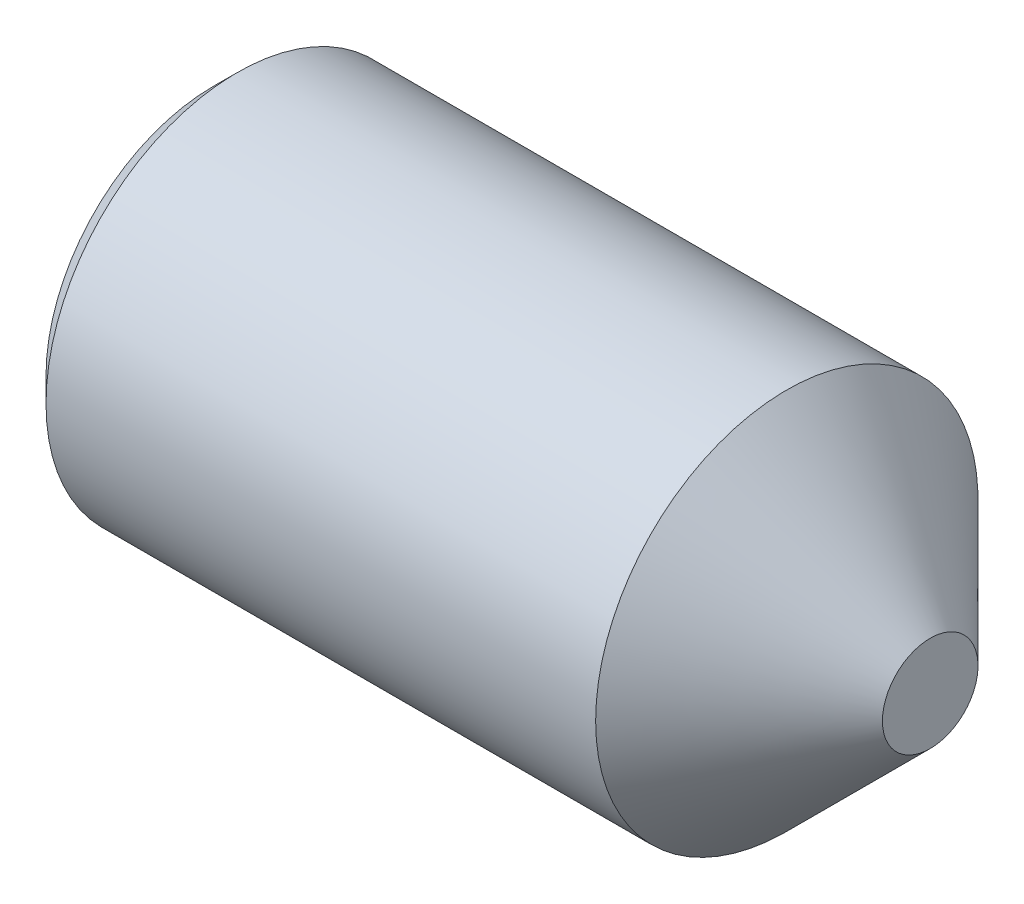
ISO-10303-21;
HEADER;
FILE_DESCRIPTION(('STEP AP214'),'2;1');
FILE_NAME('part.step','',(''),(''),'','','');
FILE_SCHEMA(('AUTOMOTIVE_DESIGN { 1 0 10303 214 1 1 1 1 }'));
ENDSEC;
DATA;
#1=APPLICATION_CONTEXT('core data for automotive mechanical design processes');
#2=APPLICATION_PROTOCOL_DEFINITION('international standard','automotive_design',2000,#1);
#3=PRODUCT_CONTEXT('',#1,'mechanical');
#4=PRODUCT('Part','Part','',(#3));
#5=PRODUCT_RELATED_PRODUCT_CATEGORY('part','',(#4));
#6=PRODUCT_DEFINITION_FORMATION('','',#4);
#7=PRODUCT_DEFINITION_CONTEXT('part definition',#1,'design');
#8=PRODUCT_DEFINITION('design','',#6,#7);
#9=PRODUCT_DEFINITION_SHAPE('','',#8);
#10=(LENGTH_UNIT() NAMED_UNIT(*) SI_UNIT(.MILLI.,.METRE.));
#11=(NAMED_UNIT(*) PLANE_ANGLE_UNIT() SI_UNIT($,.RADIAN.));
#12=(NAMED_UNIT(*) SI_UNIT($,.STERADIAN.) SOLID_ANGLE_UNIT());
#13=UNCERTAINTY_MEASURE_WITH_UNIT(LENGTH_MEASURE(1.E-05),#10,'distance_accuracy_value','');
#14=(GEOMETRIC_REPRESENTATION_CONTEXT(3) GLOBAL_UNCERTAINTY_ASSIGNED_CONTEXT((#13)) GLOBAL_UNIT_ASSIGNED_CONTEXT((#10,
#11,#12)) REPRESENTATION_CONTEXT('',''));
#15=CARTESIAN_POINT('',(0.,0.,0.));
#16=DIRECTION('',(0.,0.,1.));
#17=DIRECTION('',(1.,0.,0.));
#18=AXIS2_PLACEMENT_3D('',#15,#16,#17);
#19=CARTESIAN_POINT('',(0.699999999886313,0.,0.404145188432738));
#20=DIRECTION('',(-1.,0.,0.));
#21=DIRECTION('',(0.,0.,1.));
#22=AXIS2_PLACEMENT_3D('',#19,#20,#21);
#23=PLANE('',#22);
#24=DIRECTION('',(0.,0.,-1.));
#25=VECTOR('',#24,1.);
#26=CARTESIAN_POINT('',(0.699999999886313,0.35,0.202072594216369));
#27=LINE('',#26,#25);
#28=CARTESIAN_POINT('',(0.699999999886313,0.35,0.202072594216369));
#29=VERTEX_POINT('',#28);
#30=CARTESIAN_POINT('',(0.699999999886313,0.35,0.));
#31=VERTEX_POINT('',#30);
#32=EDGE_CURVE('E167',#29,#31,#27,.T.);
#33=ORIENTED_EDGE('',*,*,#32,.T.);
#34=CARTESIAN_POINT('',(0.699999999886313,0.,0.));
#35=DIRECTION('',(1.,0.,0.));
#36=DIRECTION('',(0.,1.,0.));
#37=AXIS2_PLACEMENT_3D('',#34,#35,#36);
#38=CIRCLE('',#37,0.35);
#39=CARTESIAN_POINT('',(0.699999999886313,0.175,0.303108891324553));
#40=VERTEX_POINT('',#39);
#41=EDGE_CURVE('E54',#31,#40,#38,.T.);
#42=ORIENTED_EDGE('',*,*,#41,.T.);
#43=DIRECTION('',(0.,0.866025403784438,-0.500000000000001));
#44=VECTOR('',#43,1.);
#45=CARTESIAN_POINT('',(0.699999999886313,0.,0.404145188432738));
#46=LINE('',#45,#44);
#47=EDGE_CURVE('E223',#40,#29,#46,.T.);
#48=ORIENTED_EDGE('',*,*,#47,.T.);
#49=EDGE_LOOP('',(#33,#42,#48));
#50=FACE_BOUND('',#49,.T.);
#51=ADVANCED_FACE('F43',(#50),#23,.T.);
#52=CARTESIAN_POINT('',(0.699999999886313,0.,0.404145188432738));
#53=VERTEX_POINT('',#52);
#54=EDGE_CURVE('E228',#53,#40,#46,.T.);
#55=ORIENTED_EDGE('',*,*,#54,.T.);
#56=CARTESIAN_POINT('',(0.699999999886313,-0.175,0.303108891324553));
#57=VERTEX_POINT('',#56);
#58=EDGE_CURVE('E11',#40,#57,#38,.T.);
#59=ORIENTED_EDGE('',*,*,#58,.T.);
#60=DIRECTION('',(0.,0.866025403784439,0.5));
#61=VECTOR('',#60,1.);
#62=CARTESIAN_POINT('',(0.699999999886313,-0.349999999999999,0.202072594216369));
#63=LINE('',#62,#61);
#64=EDGE_CURVE('E193',#57,#53,#63,.T.);
#65=ORIENTED_EDGE('',*,*,#64,.T.);
#66=EDGE_LOOP('',(#55,#59,#65));
#67=FACE_BOUND('',#66,.T.);
#68=ADVANCED_FACE('F130',(#67),#23,.T.);
#69=CARTESIAN_POINT('',(0.699999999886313,-0.349999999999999,0.202072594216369));
#70=VERTEX_POINT('',#69);
#71=EDGE_CURVE('E229',#70,#57,#63,.T.);
#72=ORIENTED_EDGE('',*,*,#71,.T.);
#73=CARTESIAN_POINT('',(0.699999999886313,-0.35,0.));
#74=VERTEX_POINT('',#73);
#75=EDGE_CURVE('E52',#57,#74,#38,.T.);
#76=ORIENTED_EDGE('',*,*,#75,.T.);
#77=DIRECTION('',(0.,0.,1.));
#78=VECTOR('',#77,1.);
#79=CARTESIAN_POINT('',(0.699999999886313,-0.35,-0.202072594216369));
#80=LINE('',#79,#78);
#81=EDGE_CURVE('E172',#74,#70,#80,.T.);
#82=ORIENTED_EDGE('',*,*,#81,.T.);
#83=EDGE_LOOP('',(#72,#76,#82));
#84=FACE_BOUND('',#83,.T.);
#85=ADVANCED_FACE('F137',(#84),#23,.T.);
#86=CARTESIAN_POINT('',(0.699999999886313,-0.35,-0.202072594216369));
#87=VERTEX_POINT('',#86);
#88=EDGE_CURVE('E173',#87,#74,#80,.T.);
#89=ORIENTED_EDGE('',*,*,#88,.T.);
#90=CARTESIAN_POINT('',(0.699999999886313,-0.175,-0.303108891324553));
#91=VERTEX_POINT('',#90);
#92=EDGE_CURVE('E220',#74,#91,#38,.T.);
#93=ORIENTED_EDGE('',*,*,#92,.T.);
#94=DIRECTION('',(0.,-0.866025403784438,0.5));
#95=VECTOR('',#94,1.);
#96=CARTESIAN_POINT('',(0.699999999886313,0.,-0.404145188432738));
#97=LINE('',#96,#95);
#98=EDGE_CURVE('E162',#91,#87,#97,.T.);
#99=ORIENTED_EDGE('',*,*,#98,.T.);
#100=EDGE_LOOP('',(#89,#93,#99));
#101=FACE_BOUND('',#100,.T.);
#102=ADVANCED_FACE('F151',(#101),#23,.T.);
#103=CARTESIAN_POINT('',(0.699999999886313,0.,-0.404145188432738));
#104=VERTEX_POINT('',#103);
#105=EDGE_CURVE('E165',#104,#91,#97,.T.);
#106=ORIENTED_EDGE('',*,*,#105,.T.);
#107=CARTESIAN_POINT('',(0.699999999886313,0.175,-0.303108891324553));
#108=VERTEX_POINT('',#107);
#109=EDGE_CURVE('E218',#91,#108,#38,.T.);
#110=ORIENTED_EDGE('',*,*,#109,.T.);
#111=DIRECTION('',(0.,-0.866025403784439,-0.5));
#112=VECTOR('',#111,1.);
#113=CARTESIAN_POINT('',(0.699999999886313,0.35,-0.202072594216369));
#114=LINE('',#113,#112);
#115=EDGE_CURVE('E163',#108,#104,#114,.T.);
#116=ORIENTED_EDGE('',*,*,#115,.T.);
#117=EDGE_LOOP('',(#106,#110,#116));
#118=FACE_BOUND('',#117,.T.);
#119=ADVANCED_FACE('F142',(#118),#23,.T.);
#120=CARTESIAN_POINT('',(0.699999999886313,0.35,-0.202072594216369));
#121=VERTEX_POINT('',#120);
#122=EDGE_CURVE('E155',#121,#108,#114,.T.);
#123=ORIENTED_EDGE('',*,*,#122,.T.);
#124=EDGE_CURVE('E156',#108,#31,#38,.T.);
#125=ORIENTED_EDGE('',*,*,#124,.T.);
#126=EDGE_CURVE('E158',#31,#121,#27,.T.);
#127=ORIENTED_EDGE('',*,*,#126,.T.);
#128=EDGE_LOOP('',(#123,#125,#127));
#129=FACE_BOUND('',#128,.T.);
#130=ADVANCED_FACE('F132',(#129),#23,.T.);
#131=CARTESIAN_POINT('',(0.,0.7,0.));
#132=DIRECTION('',(1.,0.,0.));
#133=DIRECTION('',(0.,0.,-1.));
#134=AXIS2_PLACEMENT_3D('',#131,#132,#133);
#135=PLANE('',#134);
#136=DIRECTION('',(0.,0.866025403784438,-0.500000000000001));
#137=VECTOR('',#136,1.);
#138=CARTESIAN_POINT('',(-1.13686837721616E-10,0.,0.404145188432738));
#139=LINE('',#138,#137);
#140=CARTESIAN_POINT('',(0.,0.,0.404145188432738));
#141=VERTEX_POINT('',#140);
#142=CARTESIAN_POINT('',(-1.13686837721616E-10,0.35,0.202072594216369));
#143=VERTEX_POINT('',#142);
#144=EDGE_CURVE('E178',#141,#143,#139,.T.);
#145=ORIENTED_EDGE('',*,*,#144,.F.);
#146=DIRECTION('',(0.,0.866025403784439,0.5));
#147=VECTOR('',#146,1.);
#148=CARTESIAN_POINT('',(-1.13686837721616E-10,-0.349999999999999,0.202072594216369));
#149=LINE('',#148,#147);
#150=CARTESIAN_POINT('',(-1.13686837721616E-10,-0.349999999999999,0.202072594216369));
#151=VERTEX_POINT('',#150);
#152=EDGE_CURVE('E68',#151,#141,#149,.T.);
#153=ORIENTED_EDGE('',*,*,#152,.F.);
#154=DIRECTION('',(0.,0.,1.));
#155=VECTOR('',#154,1.);
#156=CARTESIAN_POINT('',(-1.13686837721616E-10,-0.35,-0.202072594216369));
#157=LINE('',#156,#155);
#158=CARTESIAN_POINT('',(-1.13686837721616E-10,-0.35,-0.202072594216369));
#159=VERTEX_POINT('',#158);
#160=EDGE_CURVE('E190',#159,#151,#157,.T.);
#161=ORIENTED_EDGE('',*,*,#160,.F.);
#162=DIRECTION('',(0.,-0.866025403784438,0.5));
#163=VECTOR('',#162,1.);
#164=CARTESIAN_POINT('',(-1.13686837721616E-10,0.,-0.404145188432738));
#165=LINE('',#164,#163);
#166=CARTESIAN_POINT('',(-1.13686837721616E-10,0.,-0.404145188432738));
#167=VERTEX_POINT('',#166);
#168=EDGE_CURVE('E187',#167,#159,#165,.T.);
#169=ORIENTED_EDGE('',*,*,#168,.F.);
#170=DIRECTION('',(0.,-0.866025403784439,-0.5));
#171=VECTOR('',#170,1.);
#172=CARTESIAN_POINT('',(-1.13686837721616E-10,0.35,-0.202072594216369));
#173=LINE('',#172,#171);
#174=CARTESIAN_POINT('',(-1.13686837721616E-10,0.35,-0.202072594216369));
#175=VERTEX_POINT('',#174);
#176=EDGE_CURVE('E184',#175,#167,#173,.T.);
#177=ORIENTED_EDGE('',*,*,#176,.F.);
#178=DIRECTION('',(0.,0.,-1.));
#179=VECTOR('',#178,1.);
#180=CARTESIAN_POINT('',(-1.13686837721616E-10,0.35,0.202072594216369));
#181=LINE('',#180,#179);
#182=EDGE_CURVE('E181',#143,#175,#181,.T.);
#183=ORIENTED_EDGE('',*,*,#182,.F.);
#184=EDGE_LOOP('',(#145,#153,#161,#169,#177,#183));
#185=FACE_BOUND('',#184,.T.);
#186=CARTESIAN_POINT('',(0.,0.,0.));
#187=DIRECTION('',(-1.,0.,0.));
#188=DIRECTION('',(0.,0.,1.));
#189=AXIS2_PLACEMENT_3D('',#186,#187,#188);
#190=CIRCLE('',#189,0.7);
#191=CARTESIAN_POINT('',(0.,0.,0.7));
#192=VERTEX_POINT('',#191);
#193=EDGE_CURVE('E196',#192,#192,#190,.T.);
#194=ORIENTED_EDGE('',*,*,#193,.T.);
#195=EDGE_LOOP('',(#194));
#196=FACE_BOUND('',#195,.T.);
#197=ADVANCED_FACE('F45',(#185,#196),#135,.F.);
#198=CARTESIAN_POINT('',(3.,0.,0.));
#199=DIRECTION('',(-1.,0.,0.));
#200=DIRECTION('',(0.,0.,1.));
#201=AXIS2_PLACEMENT_3D('',#198,#199,#200);
#202=PLANE('',#201);
#203=CARTESIAN_POINT('',(3.,0.,0.));
#204=DIRECTION('',(-1.,0.,0.));
#205=DIRECTION('',(0.,0.,1.));
#206=AXIS2_PLACEMENT_3D('',#203,#204,#205);
#207=CIRCLE('',#206,0.2);
#208=CARTESIAN_POINT('',(3.,0.,0.2));
#209=VERTEX_POINT('',#208);
#210=EDGE_CURVE('E47',#209,#209,#207,.T.);
#211=ORIENTED_EDGE('',*,*,#210,.F.);
#212=EDGE_LOOP('',(#211));
#213=FACE_BOUND('',#212,.T.);
#214=ADVANCED_FACE('F149',(#213),#202,.F.);
#215=CARTESIAN_POINT('',(3.,0.,0.));
#216=DIRECTION('',(-1.,0.,0.));
#217=DIRECTION('',(0.,0.,1.));
#218=AXIS2_PLACEMENT_3D('',#215,#216,#217);
#219=CONICAL_SURFACE('',#218,0.2,0.785398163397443);
#220=CARTESIAN_POINT('',(2.39999999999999,0.,0.));
#221=DIRECTION('',(-1.,0.,0.));
#222=DIRECTION('',(0.,0.,1.));
#223=AXIS2_PLACEMENT_3D('',#220,#221,#222);
#224=CIRCLE('',#223,0.8);
#225=CARTESIAN_POINT('',(2.39999999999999,0.,0.8));
#226=VERTEX_POINT('',#225);
#227=EDGE_CURVE('E211',#226,#226,#224,.T.);
#228=CARTESIAN_POINT('',(2.39999999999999,0.,0.8));
#229=CARTESIAN_POINT('',(2.40624999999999,0.,0.79375));
#230=CARTESIAN_POINT('',(2.41249999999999,0.,0.7875));
#231=CARTESIAN_POINT('',(2.42499999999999,0.,0.775));
#232=CARTESIAN_POINT('',(2.43124999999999,0.,0.76875));
#233=CARTESIAN_POINT('',(2.44374999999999,0.,0.75625));
#234=CARTESIAN_POINT('',(2.44999999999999,0.,0.75));
#235=CARTESIAN_POINT('',(2.4625,0.,0.7375));
#236=CARTESIAN_POINT('',(2.46875,0.,0.73125));
#237=CARTESIAN_POINT('',(2.48125,0.,0.71875));
#238=CARTESIAN_POINT('',(2.4875,0.,0.7125));
#239=CARTESIAN_POINT('',(2.5,0.,0.7));
#240=CARTESIAN_POINT('',(2.50625,0.,0.69375));
#241=CARTESIAN_POINT('',(2.51875,0.,0.68125));
#242=CARTESIAN_POINT('',(2.525,0.,0.675));
#243=CARTESIAN_POINT('',(2.5375,0.,0.6625));
#244=CARTESIAN_POINT('',(2.54375,0.,0.65625));
#245=CARTESIAN_POINT('',(2.55625,0.,0.64375));
#246=CARTESIAN_POINT('',(2.5625,0.,0.6375));
#247=CARTESIAN_POINT('',(2.575,0.,0.625));
#248=CARTESIAN_POINT('',(2.58125,0.,0.61875));
#249=CARTESIAN_POINT('',(2.59375,0.,0.60625));
#250=CARTESIAN_POINT('',(2.6,0.,0.6));
#251=CARTESIAN_POINT('',(2.6125,0.,0.5875));
#252=CARTESIAN_POINT('',(2.61875,0.,0.58125));
#253=CARTESIAN_POINT('',(2.63125,0.,0.56875));
#254=CARTESIAN_POINT('',(2.6375,0.,0.5625));
#255=CARTESIAN_POINT('',(2.65,0.,0.55));
#256=CARTESIAN_POINT('',(2.65625,0.,0.54375));
#257=CARTESIAN_POINT('',(2.66875,0.,0.53125));
#258=CARTESIAN_POINT('',(2.675,0.,0.525));
#259=CARTESIAN_POINT('',(2.6875,0.,0.5125));
#260=CARTESIAN_POINT('',(2.69375,0.,0.50625));
#261=CARTESIAN_POINT('',(2.70625,0.,0.49375));
#262=CARTESIAN_POINT('',(2.7125,0.,0.4875));
#263=CARTESIAN_POINT('',(2.725,0.,0.475));
#264=CARTESIAN_POINT('',(2.73125,0.,0.46875));
#265=CARTESIAN_POINT('',(2.74375,0.,0.45625));
#266=CARTESIAN_POINT('',(2.75,0.,0.45));
#267=CARTESIAN_POINT('',(2.7625,0.,0.4375));
#268=CARTESIAN_POINT('',(2.76875,0.,0.43125));
#269=CARTESIAN_POINT('',(2.78125,0.,0.41875));
#270=CARTESIAN_POINT('',(2.7875,0.,0.4125));
#271=CARTESIAN_POINT('',(2.8,0.,0.4));
#272=CARTESIAN_POINT('',(2.80625,0.,0.39375));
#273=CARTESIAN_POINT('',(2.81875,0.,0.38125));
#274=CARTESIAN_POINT('',(2.825,0.,0.375));
#275=CARTESIAN_POINT('',(2.8375,0.,0.3625));
#276=CARTESIAN_POINT('',(2.84375,0.,0.35625));
#277=CARTESIAN_POINT('',(2.85625,0.,0.34375));
#278=CARTESIAN_POINT('',(2.8625,0.,0.3375));
#279=CARTESIAN_POINT('',(2.875,0.,0.325));
#280=CARTESIAN_POINT('',(2.88125,0.,0.31875));
#281=CARTESIAN_POINT('',(2.89375,0.,0.30625));
#282=CARTESIAN_POINT('',(2.9,0.,0.3));
#283=CARTESIAN_POINT('',(2.9125,0.,0.2875));
#284=CARTESIAN_POINT('',(2.91875,0.,0.28125));
#285=CARTESIAN_POINT('',(2.93125,0.,0.26875));
#286=CARTESIAN_POINT('',(2.9375,0.,0.2625));
#287=CARTESIAN_POINT('',(2.95,0.,0.25));
#288=CARTESIAN_POINT('',(2.95625,0.,0.24375));
#289=CARTESIAN_POINT('',(2.96875,0.,0.23125));
#290=CARTESIAN_POINT('',(2.975,0.,0.225));
#291=CARTESIAN_POINT('',(2.9875,0.,0.2125));
#292=CARTESIAN_POINT('',(2.99375,0.,0.20625));
#293=CARTESIAN_POINT('',(3.,0.,0.2));
#294=B_SPLINE_CURVE_WITH_KNOTS('',3,(#228,#229,#230,#231,#232,#233,#234,#235,#236,#237,#238,
#239,#240,#241,#242,#243,#244,#245,#246,#247,#248,#249,#250,#251,#252,#253,#254,#255,#256,#257,
#258,#259,#260,#261,#262,#263,#264,#265,#266,#267,#268,#269,#270,#271,#272,#273,#274,#275,#276,
#277,#278,#279,#280,#281,#282,#283,#284,#285,#286,#287,#288,#289,#290,#291,#292,#293),
.UNSPECIFIED.,.F.,.F.,(4,2,2,2,2,2,2,2,2,2,2,2,2,2,2,2,2,2,2,2,2,2,2,2,2,2,2,2,2,2,2,2,4),(0.,
0.026516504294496,0.0530330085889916,0.0795495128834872,0.106066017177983,0.132582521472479,
0.159099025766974,0.18561553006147,0.212132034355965,0.238648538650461,0.265165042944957,
0.291681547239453,0.318198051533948,0.344714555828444,0.37123106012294,0.397747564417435,
0.424264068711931,0.450780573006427,0.477297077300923,0.503813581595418,0.530330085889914,
0.55684659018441,0.583363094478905,0.609879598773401,0.636396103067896,0.662912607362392,
0.689429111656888,0.715945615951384,0.742462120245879,0.768978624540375,0.795495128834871,
0.822011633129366,0.848528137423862),.UNSPECIFIED.);
#295=EDGE_CURVE('BSEAM275',#226,#209,#294,.T.);
#296=ORIENTED_EDGE('',*,*,#227,.F.);
#297=ORIENTED_EDGE('',*,*,#210,.T.);
#298=ORIENTED_EDGE('',*,*,#295,.T.);
#299=ORIENTED_EDGE('',*,*,#295,.F.);
#300=EDGE_LOOP('',(#296,#298,#297,#299));
#301=FACE_BOUND('',#300,.T.);
#302=ADVANCED_FACE('F275',(#301),#219,.T.);
#303=CARTESIAN_POINT('',(-14.774129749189,0.,0.));
#304=DIRECTION('',(-1.,0.,0.));
#305=DIRECTION('',(0.,0.,1.));
#306=AXIS2_PLACEMENT_3D('',#303,#304,#305);
#307=CYLINDRICAL_SURFACE('',#306,0.8);
#308=CARTESIAN_POINT('',(0.100000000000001,0.,0.));
#309=DIRECTION('',(-1.,0.,0.));
#310=DIRECTION('',(0.,0.,1.));
#311=AXIS2_PLACEMENT_3D('',#308,#309,#310);
#312=CIRCLE('',#311,0.8);
#313=CARTESIAN_POINT('',(0.100000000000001,0.,0.8));
#314=VERTEX_POINT('',#313);
#315=EDGE_CURVE('E209',#314,#314,#312,.T.);
#316=ORIENTED_EDGE('',*,*,#315,.F.);
#317=EDGE_LOOP('',(#316));
#318=FACE_BOUND('',#317,.T.);
#319=ORIENTED_EDGE('',*,*,#227,.T.);
#320=EDGE_LOOP('',(#319));
#321=FACE_BOUND('',#320,.T.);
#322=ADVANCED_FACE('F271',(#318,#321),#307,.T.);
#323=CARTESIAN_POINT('',(0.100000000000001,0.,0.));
#324=DIRECTION('',(1.,0.,0.));
#325=DIRECTION('',(0.,0.,-1.));
#326=AXIS2_PLACEMENT_3D('',#323,#324,#325);
#327=CONICAL_SURFACE('',#326,0.8,0.785398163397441);
#328=ORIENTED_EDGE('',*,*,#193,.F.);
#329=EDGE_LOOP('',(#328));
#330=FACE_BOUND('',#329,.T.);
#331=ORIENTED_EDGE('',*,*,#315,.T.);
#332=EDGE_LOOP('',(#331));
#333=FACE_BOUND('',#332,.T.);
#334=ADVANCED_FACE('F262',(#330,#333),#327,.T.);
#335=CARTESIAN_POINT('',(0.699999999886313,-0.349999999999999,0.202072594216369));
#336=DIRECTION('',(0.,-0.5,0.866025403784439));
#337=DIRECTION('',(0.,-0.866025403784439,-0.5));
#338=AXIS2_PLACEMENT_3D('',#335,#336,#337);
#339=PLANE('',#338);
#340=ORIENTED_EDGE('',*,*,#152,.T.);
#341=DIRECTION('',(-1.,0.,0.));
#342=VECTOR('',#341,1.);
#343=CARTESIAN_POINT('',(0.699999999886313,0.,0.404145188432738));
#344=LINE('',#343,#342);
#345=EDGE_CURVE('E176',#53,#141,#344,.T.);
#346=ORIENTED_EDGE('',*,*,#345,.F.);
#347=ORIENTED_EDGE('',*,*,#64,.F.);
#348=ORIENTED_EDGE('',*,*,#71,.F.);
#349=DIRECTION('',(-1.,0.,0.));
#350=VECTOR('',#349,1.);
#351=CARTESIAN_POINT('',(0.699999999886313,-0.349999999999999,0.202072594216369));
#352=LINE('',#351,#350);
#353=EDGE_CURVE('E194',#70,#151,#352,.T.);
#354=ORIENTED_EDGE('',*,*,#353,.T.);
#355=EDGE_LOOP('',(#340,#346,#347,#348,#354));
#356=FACE_BOUND('',#355,.T.);
#357=ADVANCED_FACE('F237',(#356),#339,.F.);
#358=CARTESIAN_POINT('',(0.699999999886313,-0.35,-0.202072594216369));
#359=DIRECTION('',(0.,-1.,0.));
#360=DIRECTION('',(0.,0.,-1.));
#361=AXIS2_PLACEMENT_3D('',#358,#359,#360);
#362=PLANE('',#361);
#363=ORIENTED_EDGE('',*,*,#160,.T.);
#364=ORIENTED_EDGE('',*,*,#353,.F.);
#365=ORIENTED_EDGE('',*,*,#81,.F.);
#366=ORIENTED_EDGE('',*,*,#88,.F.);
#367=DIRECTION('',(-1.,0.,0.));
#368=VECTOR('',#367,1.);
#369=CARTESIAN_POINT('',(0.699999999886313,-0.35,-0.202072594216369));
#370=LINE('',#369,#368);
#371=EDGE_CURVE('E197',#87,#159,#370,.T.);
#372=ORIENTED_EDGE('',*,*,#371,.T.);
#373=EDGE_LOOP('',(#363,#364,#365,#366,#372));
#374=FACE_BOUND('',#373,.T.);
#375=ADVANCED_FACE('F256',(#374),#362,.F.);
#376=CARTESIAN_POINT('',(0.699999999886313,0.,-0.404145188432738));
#377=DIRECTION('',(0.,-0.5,-0.866025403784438));
#378=DIRECTION('',(0.,0.866025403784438,-0.5));
#379=AXIS2_PLACEMENT_3D('',#376,#377,#378);
#380=PLANE('',#379);
#381=ORIENTED_EDGE('',*,*,#168,.T.);
#382=ORIENTED_EDGE('',*,*,#371,.F.);
#383=ORIENTED_EDGE('',*,*,#98,.F.);
#384=ORIENTED_EDGE('',*,*,#105,.F.);
#385=DIRECTION('',(-1.,0.,0.));
#386=VECTOR('',#385,1.);
#387=CARTESIAN_POINT('',(0.699999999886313,0.,-0.404145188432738));
#388=LINE('',#387,#386);
#389=EDGE_CURVE('E199',#104,#167,#388,.T.);
#390=ORIENTED_EDGE('',*,*,#389,.T.);
#391=EDGE_LOOP('',(#381,#382,#383,#384,#390));
#392=FACE_BOUND('',#391,.T.);
#393=ADVANCED_FACE('F250',(#392),#380,.F.);
#394=CARTESIAN_POINT('',(0.699999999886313,0.35,-0.202072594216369));
#395=DIRECTION('',(0.,0.5,-0.866025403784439));
#396=DIRECTION('',(0.,0.866025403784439,0.5));
#397=AXIS2_PLACEMENT_3D('',#394,#395,#396);
#398=PLANE('',#397);
#399=ORIENTED_EDGE('',*,*,#176,.T.);
#400=ORIENTED_EDGE('',*,*,#389,.F.);
#401=ORIENTED_EDGE('',*,*,#115,.F.);
#402=ORIENTED_EDGE('',*,*,#122,.F.);
#403=DIRECTION('',(-1.,0.,0.));
#404=VECTOR('',#403,1.);
#405=CARTESIAN_POINT('',(0.699999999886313,0.35,-0.202072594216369));
#406=LINE('',#405,#404);
#407=EDGE_CURVE('E201',#121,#175,#406,.T.);
#408=ORIENTED_EDGE('',*,*,#407,.T.);
#409=EDGE_LOOP('',(#399,#400,#401,#402,#408));
#410=FACE_BOUND('',#409,.T.);
#411=ADVANCED_FACE('F245',(#410),#398,.F.);
#412=CARTESIAN_POINT('',(0.699999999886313,0.35,0.202072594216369));
#413=DIRECTION('',(0.,1.,0.));
#414=DIRECTION('',(0.,0.,1.));
#415=AXIS2_PLACEMENT_3D('',#412,#413,#414);
#416=PLANE('',#415);
#417=ORIENTED_EDGE('',*,*,#182,.T.);
#418=ORIENTED_EDGE('',*,*,#407,.F.);
#419=ORIENTED_EDGE('',*,*,#126,.F.);
#420=ORIENTED_EDGE('',*,*,#32,.F.);
#421=DIRECTION('',(-1.,0.,0.));
#422=VECTOR('',#421,1.);
#423=CARTESIAN_POINT('',(0.699999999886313,0.35,0.202072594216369));
#424=LINE('',#423,#422);
#425=EDGE_CURVE('E203',#29,#143,#424,.T.);
#426=ORIENTED_EDGE('',*,*,#425,.T.);
#427=EDGE_LOOP('',(#417,#418,#419,#420,#426));
#428=FACE_BOUND('',#427,.T.);
#429=ADVANCED_FACE('F125',(#428),#416,.F.);
#430=CARTESIAN_POINT('',(0.699999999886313,0.,0.404145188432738));
#431=DIRECTION('',(0.,0.500000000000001,0.866025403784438));
#432=DIRECTION('',(0.,-0.866025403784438,0.500000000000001));
#433=AXIS2_PLACEMENT_3D('',#430,#431,#432);
#434=PLANE('',#433);
#435=ORIENTED_EDGE('',*,*,#144,.T.);
#436=ORIENTED_EDGE('',*,*,#425,.F.);
#437=ORIENTED_EDGE('',*,*,#47,.F.);
#438=ORIENTED_EDGE('',*,*,#54,.F.);
#439=ORIENTED_EDGE('',*,*,#345,.T.);
#440=EDGE_LOOP('',(#435,#436,#437,#438,#439));
#441=FACE_BOUND('',#440,.T.);
#442=ADVANCED_FACE('F120',(#441),#434,.F.);
#443=CARTESIAN_POINT('',(0.902072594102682,0.,0.));
#444=DIRECTION('',(-1.,0.,0.));
#445=DIRECTION('',(0.,-1.,0.));
#446=AXIS2_PLACEMENT_3D('',#443,#444,#445);
#447=CONICAL_SURFACE('',#446,0.,1.0471975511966);
#448=ORIENTED_EDGE('',*,*,#41,.F.);
#449=ORIENTED_EDGE('',*,*,#124,.F.);
#450=ORIENTED_EDGE('',*,*,#109,.F.);
#451=ORIENTED_EDGE('',*,*,#92,.F.);
#452=ORIENTED_EDGE('',*,*,#75,.F.);
#453=ORIENTED_EDGE('',*,*,#58,.F.);
#454=EDGE_LOOP('',(#448,#449,#450,#451,#452,#453));
#455=FACE_BOUND('',#454,.T.);
#456=CARTESIAN_POINT('',(0.902072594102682,0.,0.));
#457=VERTEX_POINT('',#456);
#458=VERTEX_LOOP('',#457);
#459=FACE_BOUND('',#458,.T.);
#460=ADVANCED_FACE('F118',(#455,#459),#447,.F.);
#461=CLOSED_SHELL('',(#51,#68,#85,#102,#119,#130,#197,#214,#302,#322,#334,#357,#375,#393,#411,
#429,#442,#460));
#462=MANIFOLD_SOLID_BREP('B2',#461);
#463=ADVANCED_BREP_SHAPE_REPRESENTATION('',(#18,#462),#14);
#464=SHAPE_DEFINITION_REPRESENTATION(#9,#463);
ENDSEC;
END-ISO-10303-21;
